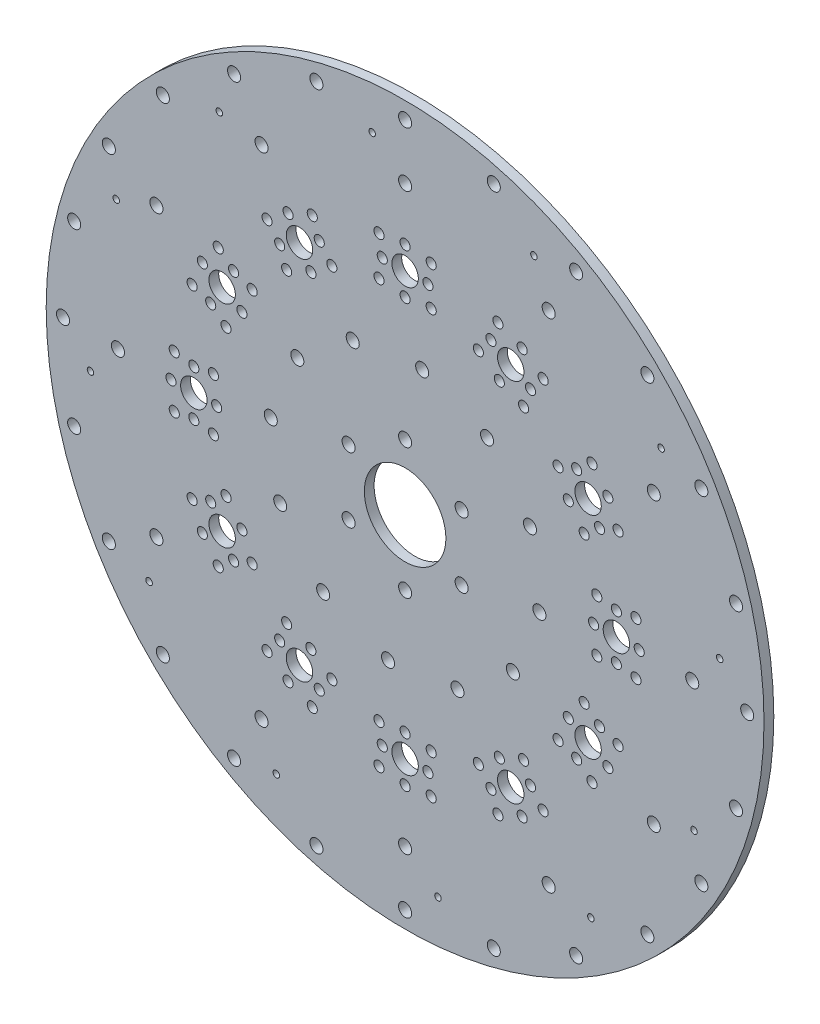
from build123d import *

# Parameters (mm, degrees)
SKETCH_1_R      = 110
SKETCH_1_R_2    = 2
SKETCH_1_R_3    = 1
SKETCH_1_R_4    = 1.55
SKETCH_1_R_5    = 4.05
SKETCH_1_R_6    = 12.5
EXTRUDE_1_DEPTH = 3


with BuildPart() as part:
    # Sketch 1 → Extrude 1 (new body)
    with BuildSketch(Plane.XY):
        Circle(SKETCH_1_R)
        with Locations((-74.246212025, -74.246212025)):
            Circle(SKETCH_1_R_2, mode=Mode.SUBTRACT)
        with Locations((-78.462169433, -56.93953607)):
            Circle(SKETCH_1_R_3, mode=Mode.SUBTRACT)
        with Locations((-52.42, -90.794103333)):
            Circle(SKETCH_1_R_2, mode=Mode.SUBTRACT)
        with Locations((-39.48046393, -88.542169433)):
            Circle(SKETCH_1_R_3, mode=Mode.SUBTRACT)
        with Locations((-27.175999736, -101.42221176)):
            Circle(SKETCH_1_R_2, mode=Mode.SUBTRACT)
        with Locations((-44, -76.210235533)):
            Circle(SKETCH_1_R_2, mode=Mode.SUBTRACT)
        with Locations((-42.303520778, -57.271847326)):
            Circle(SKETCH_1_R_4, mode=Mode.SUBTRACT)
        with Locations((-35.875317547, -62.13787273)):
            Circle(SKETCH_1_R_4, mode=Mode.SUBTRACT)
        with Locations((-28.447114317, -65.271847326)):
            Circle(SKETCH_1_R_4, mode=Mode.SUBTRACT)
        with Locations((-32.375317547, -56.075694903)):
            Circle(SKETCH_1_R_5, mode=Mode.SUBTRACT)
        with Locations((-8, -70.750635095)):
            Circle(SKETCH_1_R_4, mode=Mode.SUBTRACT)
        with Locations((0, -71.750635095)):
            Circle(SKETCH_1_R_4, mode=Mode.SUBTRACT)
        with Locations((-26.313139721, -59.575694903)):
            Circle(SKETCH_1_R_4, mode=Mode.SUBTRACT)
        with Locations((-7, -64.750635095)):
            Circle(SKETCH_1_R_4, mode=Mode.SUBTRACT)
        with Locations((0, -64.750635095)):
            Circle(SKETCH_1_R_5, mode=Mode.SUBTRACT)
        with Locations((-8, -58.750635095)):
            Circle(SKETCH_1_R_4, mode=Mode.SUBTRACT)
        with Locations((0, -57.750635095)):
            Circle(SKETCH_1_R_4, mode=Mode.SUBTRACT)
        with Locations((-90.794103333, -52.42)):
            Circle(SKETCH_1_R_2, mode=Mode.SUBTRACT)
        with Locations((-76.210235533, -44)):
            Circle(SKETCH_1_R_2, mode=Mode.SUBTRACT)
        with Locations((-57.271847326, -42.303520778)):
            Circle(SKETCH_1_R_4, mode=Mode.SUBTRACT)
        with Locations((-62.13787273, -35.875317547)):
            Circle(SKETCH_1_R_4, mode=Mode.SUBTRACT)
        with Locations((-65.271847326, -28.447114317)):
            Circle(SKETCH_1_R_4, mode=Mode.SUBTRACT)
        with Locations((-56.075694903, -32.375317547)):
            Circle(SKETCH_1_R_5, mode=Mode.SUBTRACT)
        with Locations((-101.42221176, -27.175999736)):
            Circle(SKETCH_1_R_2, mode=Mode.SUBTRACT)
        with Locations((-96.42, -10.08)):
            Circle(SKETCH_1_R_3, mode=Mode.SUBTRACT)
        with Locations((-104.84, 0)):
            Circle(SKETCH_1_R_2, mode=Mode.SUBTRACT)
        with Locations((-88, 0)):
            Circle(SKETCH_1_R_2, mode=Mode.SUBTRACT)
        with Locations((-59.575694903, -26.313139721)):
            Circle(SKETCH_1_R_4, mode=Mode.SUBTRACT)
        with Locations((-70.750635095, -8)):
            Circle(SKETCH_1_R_4, mode=Mode.SUBTRACT)
        with Locations((-64.750635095, -7)):
            Circle(SKETCH_1_R_4, mode=Mode.SUBTRACT)
        with Locations((-58.750635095, -8)):
            Circle(SKETCH_1_R_4, mode=Mode.SUBTRACT)
        with Locations((-38.437495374, -52.575694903)):
            Circle(SKETCH_1_R_4, mode=Mode.SUBTRACT)
        with Locations((-28.875317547, -50.013517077)):
            Circle(SKETCH_1_R_4, mode=Mode.SUBTRACT)
        with Locations((-36.303520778, -46.87954248)):
            Circle(SKETCH_1_R_4, mode=Mode.SUBTRACT)
        with Locations((-52.575694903, -38.437495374)):
            Circle(SKETCH_1_R_4, mode=Mode.SUBTRACT)
        with Locations((-46.87954248, -36.303520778)):
            Circle(SKETCH_1_R_4, mode=Mode.SUBTRACT)
        with Locations((-50.013517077, -28.875317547)):
            Circle(SKETCH_1_R_4, mode=Mode.SUBTRACT)
        with Locations((-22.447114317, -54.87954248)):
            Circle(SKETCH_1_R_4, mode=Mode.SUBTRACT)
        with Locations((-25.117277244, -33.035925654)):
            Circle(SKETCH_1_R_2, mode=Mode.SUBTRACT)
        with Locations((-5.23423734, -41.168589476)):
            Circle(SKETCH_1_R_2, mode=Mode.SUBTRACT)
        with Locations((-54.87954248, -22.447114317)):
            Circle(SKETCH_1_R_4, mode=Mode.SUBTRACT)
        with Locations((-38.270162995, -16.051312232)):
            Circle(SKETCH_1_R_2, mode=Mode.SUBTRACT)
        with Locations((0, -20)):
            Circle(SKETCH_1_R_2, mode=Mode.SUBTRACT)
        with Locations((-17.320508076, -10)):
            Circle(SKETCH_1_R_2, mode=Mode.SUBTRACT)
        with Locations((0, -104.84)):
            Circle(SKETCH_1_R_2, mode=Mode.SUBTRACT)
        with Locations((10.08, -96.42)):
            Circle(SKETCH_1_R_3, mode=Mode.SUBTRACT)
        with Locations((27.175999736, -101.42221176)):
            Circle(SKETCH_1_R_2, mode=Mode.SUBTRACT)
        with Locations((0, -88)):
            Circle(SKETCH_1_R_2, mode=Mode.SUBTRACT)
        with Locations((52.42, -90.794103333)):
            Circle(SKETCH_1_R_2, mode=Mode.SUBTRACT)
        with Locations((8, -70.750635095)):
            Circle(SKETCH_1_R_4, mode=Mode.SUBTRACT)
        with Locations((7, -64.750635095)):
            Circle(SKETCH_1_R_4, mode=Mode.SUBTRACT)
        with Locations((8, -58.750635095)):
            Circle(SKETCH_1_R_4, mode=Mode.SUBTRACT)
        with Locations((26.313139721, -59.575694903)):
            Circle(SKETCH_1_R_4, mode=Mode.SUBTRACT)
        with Locations((44, -76.210235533)):
            Circle(SKETCH_1_R_2, mode=Mode.SUBTRACT)
        with Locations((28.447114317, -65.271847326)):
            Circle(SKETCH_1_R_4, mode=Mode.SUBTRACT)
        with Locations((35.875317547, -62.13787273)):
            Circle(SKETCH_1_R_4, mode=Mode.SUBTRACT)
        with Locations((32.375317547, -56.075694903)):
            Circle(SKETCH_1_R_5, mode=Mode.SUBTRACT)
        with Locations((42.303520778, -57.271847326)):
            Circle(SKETCH_1_R_4, mode=Mode.SUBTRACT)
        with Locations((56.93953607, -78.462169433)):
            Circle(SKETCH_1_R_3, mode=Mode.SUBTRACT)
        with Locations((74.246212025, -74.246212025)):
            Circle(SKETCH_1_R_2, mode=Mode.SUBTRACT)
        with Locations((22.447114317, -54.87954248)):
            Circle(SKETCH_1_R_4, mode=Mode.SUBTRACT)
        with Locations((16.051312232, -38.270162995)):
            Circle(SKETCH_1_R_2, mode=Mode.SUBTRACT)
        with Locations((28.875317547, -50.013517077)):
            Circle(SKETCH_1_R_4, mode=Mode.SUBTRACT)
        with Locations((38.437495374, -52.575694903)):
            Circle(SKETCH_1_R_4, mode=Mode.SUBTRACT)
        with Locations((36.303520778, -46.87954248)):
            Circle(SKETCH_1_R_4, mode=Mode.SUBTRACT)
        with Locations((46.87954248, -36.303520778)):
            Circle(SKETCH_1_R_4, mode=Mode.SUBTRACT)
        with Locations((52.575694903, -38.437495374)):
            Circle(SKETCH_1_R_4, mode=Mode.SUBTRACT)
        with Locations((50.013517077, -28.875317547)):
            Circle(SKETCH_1_R_4, mode=Mode.SUBTRACT)
        with Locations((17.320508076, -10)):
            Circle(SKETCH_1_R_2, mode=Mode.SUBTRACT)
        with Locations((33.035925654, -25.117277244)):
            Circle(SKETCH_1_R_2, mode=Mode.SUBTRACT)
        with Locations((54.87954248, -22.447114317)):
            Circle(SKETCH_1_R_4, mode=Mode.SUBTRACT)
        with Locations((41.168589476, -5.23423734)):
            Circle(SKETCH_1_R_2, mode=Mode.SUBTRACT)
        with Locations((57.271847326, -42.303520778)):
            Circle(SKETCH_1_R_4, mode=Mode.SUBTRACT)
        with Locations((76.210235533, -44)):
            Circle(SKETCH_1_R_2, mode=Mode.SUBTRACT)
        with Locations((62.13787273, -35.875317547)):
            Circle(SKETCH_1_R_4, mode=Mode.SUBTRACT)
        with Locations((56.075694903, -32.375317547)):
            Circle(SKETCH_1_R_5, mode=Mode.SUBTRACT)
        with Locations((65.271847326, -28.447114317)):
            Circle(SKETCH_1_R_4, mode=Mode.SUBTRACT)
        with Locations((90.794103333, -52.42)):
            Circle(SKETCH_1_R_2, mode=Mode.SUBTRACT)
        with Locations((88.542169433, -39.48046393)):
            Circle(SKETCH_1_R_3, mode=Mode.SUBTRACT)
        with Locations((59.575694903, -26.313139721)):
            Circle(SKETCH_1_R_4, mode=Mode.SUBTRACT)
        with Locations((58.750635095, -8)):
            Circle(SKETCH_1_R_4, mode=Mode.SUBTRACT)
        with Locations((64.750635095, -7)):
            Circle(SKETCH_1_R_4, mode=Mode.SUBTRACT)
        with Locations((57.750635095, 0)):
            Circle(SKETCH_1_R_4, mode=Mode.SUBTRACT)
        with Locations((64.750635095, 0)):
            Circle(SKETCH_1_R_5, mode=Mode.SUBTRACT)
        with Locations((70.750635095, -8)):
            Circle(SKETCH_1_R_4, mode=Mode.SUBTRACT)
        with Locations((71.750635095, 0)):
            Circle(SKETCH_1_R_4, mode=Mode.SUBTRACT)
        with Locations((101.42221176, -27.175999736)):
            Circle(SKETCH_1_R_2, mode=Mode.SUBTRACT)
        with Locations((-101.42221176, 27.175999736)):
            Circle(SKETCH_1_R_2, mode=Mode.SUBTRACT)
        with Locations((-71.750635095, 0)):
            Circle(SKETCH_1_R_4, mode=Mode.SUBTRACT)
        with Locations((-70.750635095, 8)):
            Circle(SKETCH_1_R_4, mode=Mode.SUBTRACT)
        with Locations((-64.750635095, 0)):
            Circle(SKETCH_1_R_5, mode=Mode.SUBTRACT)
        with Locations((-57.750635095, 0)):
            Circle(SKETCH_1_R_4, mode=Mode.SUBTRACT)
        with Locations((-64.750635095, 7)):
            Circle(SKETCH_1_R_4, mode=Mode.SUBTRACT)
        with Locations((-58.750635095, 8)):
            Circle(SKETCH_1_R_4, mode=Mode.SUBTRACT)
        with Locations((-59.575694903, 26.313139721)):
            Circle(SKETCH_1_R_4, mode=Mode.SUBTRACT)
        with Locations((-88.542169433, 39.48046393)):
            Circle(SKETCH_1_R_3, mode=Mode.SUBTRACT)
        with Locations((-90.794103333, 52.42)):
            Circle(SKETCH_1_R_2, mode=Mode.SUBTRACT)
        with Locations((-65.271847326, 28.447114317)):
            Circle(SKETCH_1_R_4, mode=Mode.SUBTRACT)
        with Locations((-56.075694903, 32.375317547)):
            Circle(SKETCH_1_R_5, mode=Mode.SUBTRACT)
        with Locations((-62.13787273, 35.875317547)):
            Circle(SKETCH_1_R_4, mode=Mode.SUBTRACT)
        with Locations((-76.210235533, 44)):
            Circle(SKETCH_1_R_2, mode=Mode.SUBTRACT)
        with Locations((-57.271847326, 42.303520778)):
            Circle(SKETCH_1_R_4, mode=Mode.SUBTRACT)
        with Locations((-41.168589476, 5.23423734)):
            Circle(SKETCH_1_R_2, mode=Mode.SUBTRACT)
        with Locations((-54.87954248, 22.447114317)):
            Circle(SKETCH_1_R_4, mode=Mode.SUBTRACT)
        with Locations((-33.035925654, 25.117277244)):
            Circle(SKETCH_1_R_2, mode=Mode.SUBTRACT)
        with Locations((-17.320508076, 10)):
            Circle(SKETCH_1_R_2, mode=Mode.SUBTRACT)
        with Locations((-50.013517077, 28.875317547)):
            Circle(SKETCH_1_R_4, mode=Mode.SUBTRACT)
        with Locations((-52.575694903, 38.437495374)):
            Circle(SKETCH_1_R_4, mode=Mode.SUBTRACT)
        with Locations((-46.87954248, 36.303520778)):
            Circle(SKETCH_1_R_4, mode=Mode.SUBTRACT)
        with Locations((-36.303520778, 46.87954248)):
            Circle(SKETCH_1_R_4, mode=Mode.SUBTRACT)
        with Locations((-38.437495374, 52.575694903)):
            Circle(SKETCH_1_R_4, mode=Mode.SUBTRACT)
        with Locations((-28.875317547, 50.013517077)):
            Circle(SKETCH_1_R_4, mode=Mode.SUBTRACT)
        with Locations((-16.051312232, 38.270162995)):
            Circle(SKETCH_1_R_2, mode=Mode.SUBTRACT)
        with Locations((-22.447114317, 54.87954248)):
            Circle(SKETCH_1_R_4, mode=Mode.SUBTRACT)
        with Locations((-74.246212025, 74.246212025)):
            Circle(SKETCH_1_R_2, mode=Mode.SUBTRACT)
        with Locations((-56.93953607, 78.462169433)):
            Circle(SKETCH_1_R_3, mode=Mode.SUBTRACT)
        with Locations((-42.303520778, 57.271847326)):
            Circle(SKETCH_1_R_4, mode=Mode.SUBTRACT)
        with Locations((-32.375317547, 56.075694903)):
            Circle(SKETCH_1_R_5, mode=Mode.SUBTRACT)
        with Locations((-35.875317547, 62.13787273)):
            Circle(SKETCH_1_R_4, mode=Mode.SUBTRACT)
        with Locations((-28.447114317, 65.271847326)):
            Circle(SKETCH_1_R_4, mode=Mode.SUBTRACT)
        with Locations((-44, 76.210235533)):
            Circle(SKETCH_1_R_2, mode=Mode.SUBTRACT)
        with Locations((-26.313139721, 59.575694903)):
            Circle(SKETCH_1_R_4, mode=Mode.SUBTRACT)
        with Locations((-8, 58.750635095)):
            Circle(SKETCH_1_R_4, mode=Mode.SUBTRACT)
        with Locations((-7, 64.750635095)):
            Circle(SKETCH_1_R_4, mode=Mode.SUBTRACT)
        with Locations((-8, 70.750635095)):
            Circle(SKETCH_1_R_4, mode=Mode.SUBTRACT)
        with Locations((0, 71.750635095)):
            Circle(SKETCH_1_R_4, mode=Mode.SUBTRACT)
        with Locations((-52.42, 90.794103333)):
            Circle(SKETCH_1_R_2, mode=Mode.SUBTRACT)
        with Locations((-27.175999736, 101.42221176)):
            Circle(SKETCH_1_R_2, mode=Mode.SUBTRACT)
        with Locations((-10.08, 96.42)):
            Circle(SKETCH_1_R_3, mode=Mode.SUBTRACT)
        Circle(SKETCH_1_R_6, mode=Mode.SUBTRACT)
        with Locations((17.320508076, 10)):
            Circle(SKETCH_1_R_2, mode=Mode.SUBTRACT)
        with Locations((0, 20)):
            Circle(SKETCH_1_R_2, mode=Mode.SUBTRACT)
        with Locations((38.270162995, 16.051312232)):
            Circle(SKETCH_1_R_2, mode=Mode.SUBTRACT)
        with Locations((54.87954248, 22.447114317)):
            Circle(SKETCH_1_R_4, mode=Mode.SUBTRACT)
        with Locations((5.23423734, 41.168589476)):
            Circle(SKETCH_1_R_2, mode=Mode.SUBTRACT)
        with Locations((25.117277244, 33.035925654)):
            Circle(SKETCH_1_R_2, mode=Mode.SUBTRACT)
        with Locations((22.447114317, 54.87954248)):
            Circle(SKETCH_1_R_4, mode=Mode.SUBTRACT)
        with Locations((50.013517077, 28.875317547)):
            Circle(SKETCH_1_R_4, mode=Mode.SUBTRACT)
        with Locations((46.87954248, 36.303520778)):
            Circle(SKETCH_1_R_4, mode=Mode.SUBTRACT)
        with Locations((52.575694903, 38.437495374)):
            Circle(SKETCH_1_R_4, mode=Mode.SUBTRACT)
        with Locations((36.303520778, 46.87954248)):
            Circle(SKETCH_1_R_4, mode=Mode.SUBTRACT)
        with Locations((28.875317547, 50.013517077)):
            Circle(SKETCH_1_R_4, mode=Mode.SUBTRACT)
        with Locations((38.437495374, 52.575694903)):
            Circle(SKETCH_1_R_4, mode=Mode.SUBTRACT)
        with Locations((58.750635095, 8)):
            Circle(SKETCH_1_R_4, mode=Mode.SUBTRACT)
        with Locations((64.750635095, 7)):
            Circle(SKETCH_1_R_4, mode=Mode.SUBTRACT)
        with Locations((70.750635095, 8)):
            Circle(SKETCH_1_R_4, mode=Mode.SUBTRACT)
        with Locations((59.575694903, 26.313139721)):
            Circle(SKETCH_1_R_4, mode=Mode.SUBTRACT)
        with Locations((88, 0)):
            Circle(SKETCH_1_R_2, mode=Mode.SUBTRACT)
        with Locations((104.84, 0)):
            Circle(SKETCH_1_R_2, mode=Mode.SUBTRACT)
        with Locations((96.42, 10.08)):
            Circle(SKETCH_1_R_3, mode=Mode.SUBTRACT)
        with Locations((101.42221176, 27.175999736)):
            Circle(SKETCH_1_R_2, mode=Mode.SUBTRACT)
        with Locations((56.075694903, 32.375317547)):
            Circle(SKETCH_1_R_5, mode=Mode.SUBTRACT)
        with Locations((65.271847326, 28.447114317)):
            Circle(SKETCH_1_R_4, mode=Mode.SUBTRACT)
        with Locations((62.13787273, 35.875317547)):
            Circle(SKETCH_1_R_4, mode=Mode.SUBTRACT)
        with Locations((57.271847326, 42.303520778)):
            Circle(SKETCH_1_R_4, mode=Mode.SUBTRACT)
        with Locations((76.210235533, 44)):
            Circle(SKETCH_1_R_2, mode=Mode.SUBTRACT)
        with Locations((90.794103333, 52.42)):
            Circle(SKETCH_1_R_2, mode=Mode.SUBTRACT)
        with Locations((0, 57.750635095)):
            Circle(SKETCH_1_R_4, mode=Mode.SUBTRACT)
        with Locations((8, 58.750635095)):
            Circle(SKETCH_1_R_4, mode=Mode.SUBTRACT)
        with Locations((0, 64.750635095)):
            Circle(SKETCH_1_R_5, mode=Mode.SUBTRACT)
        with Locations((7, 64.750635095)):
            Circle(SKETCH_1_R_4, mode=Mode.SUBTRACT)
        with Locations((26.313139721, 59.575694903)):
            Circle(SKETCH_1_R_4, mode=Mode.SUBTRACT)
        with Locations((8, 70.750635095)):
            Circle(SKETCH_1_R_4, mode=Mode.SUBTRACT)
        with Locations((32.375317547, 56.075694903)):
            Circle(SKETCH_1_R_5, mode=Mode.SUBTRACT)
        with Locations((28.447114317, 65.271847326)):
            Circle(SKETCH_1_R_4, mode=Mode.SUBTRACT)
        with Locations((35.875317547, 62.13787273)):
            Circle(SKETCH_1_R_4, mode=Mode.SUBTRACT)
        with Locations((42.303520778, 57.271847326)):
            Circle(SKETCH_1_R_4, mode=Mode.SUBTRACT)
        with Locations((44, 76.210235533)):
            Circle(SKETCH_1_R_2, mode=Mode.SUBTRACT)
        with Locations((0, 88)):
            Circle(SKETCH_1_R_2, mode=Mode.SUBTRACT)
        with Locations((0, 104.84)):
            Circle(SKETCH_1_R_2, mode=Mode.SUBTRACT)
        with Locations((27.175999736, 101.42221176)):
            Circle(SKETCH_1_R_2, mode=Mode.SUBTRACT)
        with Locations((39.48046393, 88.542169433)):
            Circle(SKETCH_1_R_3, mode=Mode.SUBTRACT)
        with Locations((52.42, 90.794103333)):
            Circle(SKETCH_1_R_2, mode=Mode.SUBTRACT)
        with Locations((78.462169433, 56.93953607)):
            Circle(SKETCH_1_R_3, mode=Mode.SUBTRACT)
        with Locations((74.246212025, 74.246212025)):
            Circle(SKETCH_1_R_2, mode=Mode.SUBTRACT)
    extrude(amount=EXTRUDE_1_DEPTH)


solid = part.part
